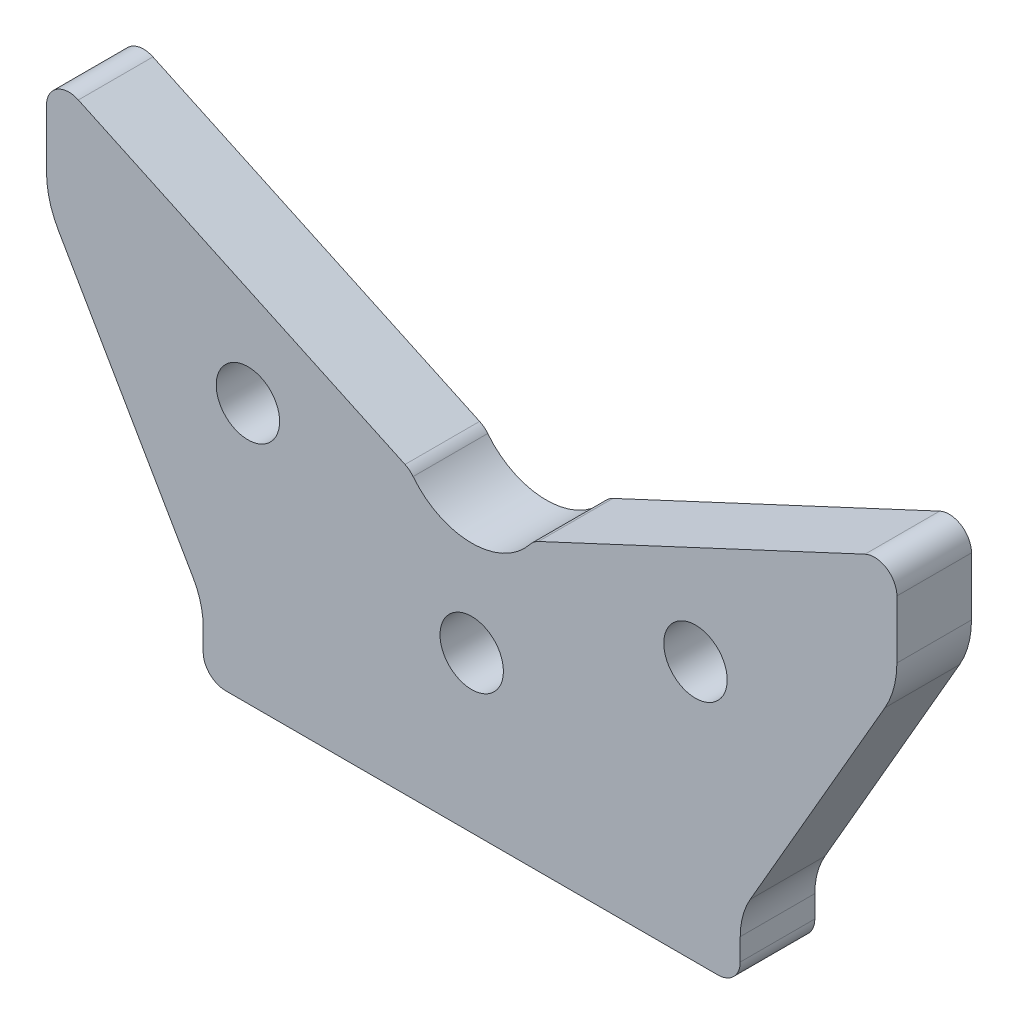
from build123d import *

# Parameters (mm, degrees)
EXTRUDE1_DEPTH         = 10
M10_GEVINDHULLER_D     = 8.5
M10_GEVINDHULLER_DEPTH = 22
M10_GEVINDHULLER_TIP   = 2.553657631


with BuildPart() as part:
    # Sketch1 → Extrude1 (new body)
    with BuildSketch(Plane.XY):
        with BuildLine():
            Line((-37.339745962, 10.947441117), (-55.392304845, 42.215390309))
            ThreePointArc((-55.392304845, 42.215390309), (-56.591109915, 45.109561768), (-57, 48.215390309))
            Line((-57, 48.215390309), (-57, 56))
            ThreePointArc((-57, 56), (-55.611898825, 58.530174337), (-52.732145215, 58.718923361))
            Line((-52.732145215, 58.718923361), (-8.939617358, 38.298132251))
            ThreePointArc((-8.939617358, 38.298132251), (-8.345295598, 37.931292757), (-7.851901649, 37.436973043))
            ThreePointArc((-7.851901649, 37.436973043), (0, 33.629520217), (7.851901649, 37.436973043))
            ThreePointArc((7.851901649, 37.436973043), (8.345295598, 37.931292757), (8.939617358, 38.298132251))
            Line((8.939617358, 38.298132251), (52.732145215, 58.718923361))
            ThreePointArc((52.732145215, 58.718923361), (55.611898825, 58.530174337), (57, 56))
            Line((57, 56), (57, 48.215390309))
            ThreePointArc((57, 48.215390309), (56.591109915, 45.109561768), (55.392304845, 42.215390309))
            Line((55.392304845, 42.215390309), (37.339745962, 10.947441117))
            ThreePointArc((37.339745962, 10.947441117), (36.340741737, 8.535631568), (36, 5.947441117))
            Line((36, 5.947441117), (36, 3))
            ThreePointArc((36, 3), (35.121320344, 0.878679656), (33, 0))
            Line((33, 0), (0, 0))
            Line((0, 0), (-33, 0))
            ThreePointArc((-33, 0), (-35.121320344, 0.878679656), (-36, 3))
            Line((-36, 3), (-36, 5.947441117))
            ThreePointArc((-36, 5.947441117), (-36.340741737, 8.535631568), (-37.339745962, 10.947441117))
        make_face()
    extrude(amount=EXTRUDE1_DEPTH)

    # M10 gevindhuller
    with Locations(Plane.XY.offset(10)):
        with Locations((-30, 34.878214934), (30, 34.878214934), (0, 20.878214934)):
            Hole(M10_GEVINDHULLER_D / 2, depth=M10_GEVINDHULLER_DEPTH)
            with Locations((0, 0, -(M10_GEVINDHULLER_DEPTH + M10_GEVINDHULLER_TIP / 2))):  # 118° drill point
                Cone(0, M10_GEVINDHULLER_D / 2, M10_GEVINDHULLER_TIP, mode=Mode.SUBTRACT)


solid = part.part
